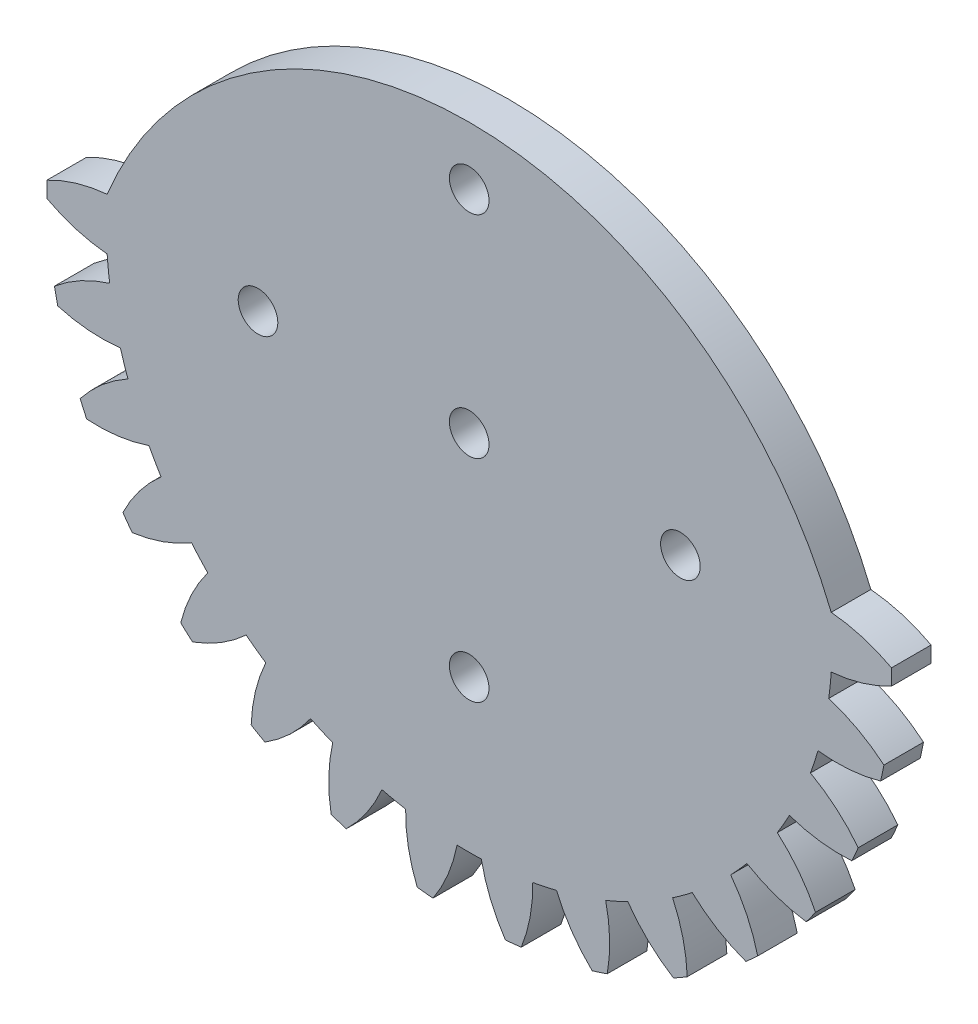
from build123d import *

# Parameters (mm, degrees)
EXTRUDE_1_DEPTH     = 3
SKETCH_2_R          = 1.5
CUT_EXTRUDE_1_DEPTH = 10
SKETCH_3_R          = 1.5
CUT_EXTRUDE_2_DEPTH = 10
CUT_EXTRUDE_3_DEPTH = 10


with BuildPart() as part:
    # Sketch 1 → Extrude 1 (new body)
    with BuildSketch(Plane.XY):
        with BuildLine():
            ThreePointArc((-88.734632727, 50.605995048), (-86.520028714, 49.698643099), (-84.169409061, 49.24881453))
            ThreePointArc((-84.169409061, 49.24881453), (-84.088655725, 48.333690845), (-83.977379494, 47.421775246))
            ThreePointArc((-83.977379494, 47.421775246), (-86.18310785, 46.493055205), (-88.160668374, 45.145089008))
            ThreePointArc((-88.160668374, 45.145089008), (-88.041021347, 44.554944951), (-87.910291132, 43.967156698))
            ThreePointArc((-87.910291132, 43.967156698), (-85.555432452, 43.540074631), (-83.16265486, 43.588797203))
            ThreePointArc((-83.16265486, 43.588797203), (-82.893401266, 42.710460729), (-82.594958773, 41.841608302))
            ThreePointArc((-82.594958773, 41.841608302), (-84.559394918, 40.47458631), (-86.213483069, 38.744918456))
            ThreePointArc((-86.213483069, 38.744918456), (-85.973752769, 38.192546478), (-85.723671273, 37.64478315))
            ThreePointArc((-85.723671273, 37.64478315), (-83.33147655, 37.7166365), (-81.001116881, 38.261780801))
            ThreePointArc((-81.001116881, 38.261780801), (-80.555130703, 37.458619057), (-80.082565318, 36.670802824))
            ThreePointArc((-80.082565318, 36.670802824), (-81.719853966, 34.925224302), (-82.978178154, 32.889449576))
            ThreePointArc((-82.978178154, 32.889449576), (-82.628841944, 32.398990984), (-82.270338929, 31.915192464))
            ThreePointArc((-82.270338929, 31.915192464), (-79.945358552, 32.482840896), (-77.779264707, 33.500581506))
            ThreePointArc((-77.779264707, 33.500581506), (-77.17603768, 32.807696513), (-76.550002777, 32.135347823))
            ThreePointArc((-76.550002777, 32.135347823), (-77.788586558, 30.087502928), (-78.596151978, 27.834594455))
            ThreePointArc((-78.596151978, 27.834594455), (-78.152477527, 27.427484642), (-77.701221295, 27.028795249))
            ThreePointArc((-77.701221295, 27.028795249), (-75.545068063, 28.067429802), (-73.637908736, 29.513286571))
            ThreePointArc((-73.637908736, 29.513286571), (-72.903804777, 28.960960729), (-72.151661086, 28.433464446))
            ThreePointArc((-72.151661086, 28.433464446), (-72.937407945, 26.172853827), (-73.258920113, 23.801274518))
            ThreePointArc((-73.258920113, 23.801274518), (-72.740298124, 23.495306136), (-72.216010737, 23.199150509))
            ThreePointArc((-72.216010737, 23.199150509), (-70.322918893, 24.663377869), (-68.758046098, 26.474159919))
            ThreePointArc((-68.758046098, 26.474159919), (-67.925149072, 26.086532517), (-67.079768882, 25.72694276))
            ThreePointArc((-67.079768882, 25.72694276), (-67.37833791, 23.35236595), (-67.199745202, 20.9657652))
            ThreePointArc((-67.199745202, 20.9657652), (-66.628841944, 20.774310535), (-66.054437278, 20.593632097))
            ThreePointArc((-66.054437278, 20.593632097), (-64.507144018, 22.419458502), (-63.352950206, 24.516025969))
            ThreePointArc((-63.352950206, 24.516025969), (-62.45766171, 24.310038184), (-61.55599219, 24.134070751))
            ThreePointArc((-61.55599219, 24.134070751), (-61.35433449, 21.749308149), (-60.683442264, 19.451991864))
            ThreePointArc((-60.683442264, 19.451991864), (-60.085208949, 19.383418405), (-59.485791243, 19.326113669))
            ThreePointArc((-59.485791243, 19.326113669), (-58.351920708, 21.433741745), (-57.658849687, 23.724464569))
            ThreePointArc((-57.658849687, 23.724464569), (-56.740298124, 23.709119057), (-55.82174656, 23.724464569))
            ThreePointArc((-55.82174656, 23.724464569), (-55.12867554, 21.433741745), (-53.994805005, 19.326113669))
            ThreePointArc((-53.994805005, 19.326113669), (-53.395387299, 19.383418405), (-52.797153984, 19.451991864))
            ThreePointArc((-52.797153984, 19.451991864), (-52.126261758, 21.749308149), (-51.924604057, 24.134070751))
            ThreePointArc((-51.924604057, 24.134070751), (-51.022934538, 24.310038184), (-50.127646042, 24.516025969))
            ThreePointArc((-50.127646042, 24.516025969), (-48.97345223, 22.419458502), (-47.42615897, 20.593632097))
            ThreePointArc((-47.42615897, 20.593632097), (-46.851754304, 20.774310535), (-46.280851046, 20.9657652))
            ThreePointArc((-46.280851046, 20.9657652), (-46.102258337, 23.35236595), (-46.400827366, 25.72694276))
            ThreePointArc((-46.400827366, 25.72694276), (-45.555447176, 26.086532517), (-44.72255015, 26.474159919))
            ThreePointArc((-44.72255015, 26.474159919), (-43.157677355, 24.663377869), (-41.264585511, 23.199150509))
            ThreePointArc((-41.264585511, 23.199150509), (-40.740298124, 23.495306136), (-40.221676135, 23.801274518))
            ThreePointArc((-40.221676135, 23.801274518), (-40.543188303, 26.172853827), (-41.328935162, 28.433464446))
            ThreePointArc((-41.328935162, 28.433464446), (-40.576791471, 28.960960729), (-39.842687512, 29.513286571))
            ThreePointArc((-39.842687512, 29.513286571), (-37.935528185, 28.067429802), (-35.779374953, 27.028795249))
            ThreePointArc((-35.779374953, 27.028795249), (-35.32811872, 27.427484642), (-34.88444427, 27.834594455))
            ThreePointArc((-34.88444427, 27.834594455), (-35.69200969, 30.087502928), (-36.930593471, 32.135347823))
            ThreePointArc((-36.930593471, 32.135347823), (-36.304558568, 32.807696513), (-35.701331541, 33.500581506))
            ThreePointArc((-35.701331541, 33.500581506), (-33.535237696, 32.482840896), (-31.210257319, 31.915192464))
            ThreePointArc((-31.210257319, 31.915192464), (-30.851754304, 32.398990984), (-30.502418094, 32.889449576))
            ThreePointArc((-30.502418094, 32.889449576), (-31.760742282, 34.925224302), (-33.39803093, 36.670802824))
            ThreePointArc((-33.39803093, 36.670802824), (-32.925465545, 37.458619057), (-32.479479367, 38.261780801))
            ThreePointArc((-32.479479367, 38.261780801), (-30.149119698, 37.7166365), (-27.756924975, 37.64478315))
            ThreePointArc((-27.756924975, 37.64478315), (-27.506843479, 38.192546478), (-27.267113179, 38.744918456))
            ThreePointArc((-27.267113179, 38.744918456), (-28.92120133, 40.47458631), (-30.885637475, 41.841608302))
            ThreePointArc((-30.885637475, 41.841608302), (-30.587194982, 42.710460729), (-30.317941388, 43.588797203))
            ThreePointArc((-30.317941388, 43.588797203), (-27.925163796, 43.540074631), (-25.570305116, 43.967156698))
            ThreePointArc((-25.570305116, 43.967156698), (-25.4395749, 44.554944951), (-25.319927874, 45.145089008))
            ThreePointArc((-25.319927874, 45.145089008), (-27.297488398, 46.493055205), (-29.503216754, 47.421775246))
            ThreePointArc((-29.503216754, 47.421775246), (-29.391940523, 48.333690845), (-29.311187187, 49.24881453))
            ThreePointArc((-29.311187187, 49.24881453), (-26.960567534, 49.698643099), (-24.745963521, 50.605995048))
            ThreePointArc((-24.745963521, 50.605995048), (-24.740298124, 51.208119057), (-24.745963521, 51.810243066))
            ThreePointArc((-24.745963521, 51.810243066), (-26.960567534, 52.717595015), (-29.311187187, 53.167423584))
            ThreePointArc((-29.311187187, 53.167423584), (-29.391940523, 54.082547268), (-29.503216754, 54.994462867))
            ThreePointArc((-29.503216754, 54.994462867), (-27.297488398, 55.923182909), (-25.319927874, 57.271149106))
            ThreePointArc((-25.319927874, 57.271149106), (-25.4395749, 57.861293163), (-25.570305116, 58.449081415))
            ThreePointArc((-25.570305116, 58.449081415), (-27.925163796, 58.876163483), (-30.317941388, 58.827440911))
            ThreePointArc((-30.317941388, 58.827440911), (-30.587194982, 59.705777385), (-30.885637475, 60.574629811))
            ThreePointArc((-30.885637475, 60.574629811), (-28.92120133, 61.941651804), (-27.267113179, 63.671319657))
            ThreePointArc((-27.267113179, 63.671319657), (-27.506843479, 64.223691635), (-27.756924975, 64.771454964))
            ThreePointArc((-27.756924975, 64.771454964), (-30.149119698, 64.699601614), (-32.479479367, 64.154457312))
            ThreePointArc((-32.479479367, 64.154457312), (-32.925465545, 64.957619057), (-33.39803093, 65.74543529))
            ThreePointArc((-33.39803093, 65.74543529), (-31.760742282, 67.491013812), (-30.502418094, 69.526788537))
            ThreePointArc((-30.502418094, 69.526788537), (-30.851754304, 70.01724713), (-31.210257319, 70.501045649))
            ThreePointArc((-31.210257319, 70.501045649), (-33.535237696, 69.933397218), (-35.701331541, 68.915656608))
            ThreePointArc((-35.701331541, 68.915656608), (-36.304558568, 69.608541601), (-36.930593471, 70.280890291))
            ThreePointArc((-36.930593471, 70.280890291), (-35.69200969, 72.328735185), (-34.88444427, 74.581643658))
            ThreePointArc((-34.88444427, 74.581643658), (-35.32811872, 74.988753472), (-35.779374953, 75.387442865))
            ThreePointArc((-35.779374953, 75.387442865), (-37.935528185, 74.348808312), (-39.842687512, 72.902951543))
            ThreePointArc((-39.842687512, 72.902951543), (-40.576791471, 73.455277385), (-41.328935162, 73.982773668))
            ThreePointArc((-41.328935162, 73.982773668), (-40.543188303, 76.243384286), (-40.221676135, 78.614963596))
            ThreePointArc((-40.221676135, 78.614963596), (-40.740298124, 78.920931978), (-41.264585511, 79.217087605))
            ThreePointArc((-41.264585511, 79.217087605), (-43.157677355, 77.752860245), (-44.72255015, 75.942078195))
            ThreePointArc((-44.72255015, 75.942078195), (-45.555447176, 76.329705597), (-46.400827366, 76.689295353))
            ThreePointArc((-46.400827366, 76.689295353), (-46.102258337, 79.063872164), (-46.280851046, 81.450472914))
            ThreePointArc((-46.280851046, 81.450472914), (-46.851754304, 81.641927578), (-47.42615897, 81.822606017))
            ThreePointArc((-47.42615897, 81.822606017), (-48.97345223, 79.996779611), (-50.127646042, 77.900212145))
            ThreePointArc((-50.127646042, 77.900212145), (-51.022934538, 78.106199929), (-51.924604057, 78.282167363))
            ThreePointArc((-51.924604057, 78.282167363), (-52.126261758, 80.666929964), (-52.797153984, 82.96424625))
            ThreePointArc((-52.797153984, 82.96424625), (-53.395387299, 83.032819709), (-53.994805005, 83.090124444))
            ThreePointArc((-53.994805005, 83.090124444), (-55.12867554, 80.982496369), (-55.82174656, 78.691773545))
            ThreePointArc((-55.82174656, 78.691773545), (-56.740298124, 78.707119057), (-57.658849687, 78.691773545))
            ThreePointArc((-57.658849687, 78.691773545), (-58.351920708, 80.982496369), (-59.485791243, 83.090124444))
            ThreePointArc((-59.485791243, 83.090124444), (-60.085208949, 83.032819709), (-60.683442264, 82.96424625))
            ThreePointArc((-60.683442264, 82.96424625), (-61.35433449, 80.666929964), (-61.55599219, 78.282167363))
            ThreePointArc((-61.55599219, 78.282167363), (-62.45766171, 78.106199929), (-63.352950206, 77.900212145))
            ThreePointArc((-63.352950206, 77.900212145), (-64.507144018, 79.996779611), (-66.054437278, 81.822606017))
            ThreePointArc((-66.054437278, 81.822606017), (-66.628841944, 81.641927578), (-67.199745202, 81.450472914))
            ThreePointArc((-67.199745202, 81.450472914), (-67.37833791, 79.063872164), (-67.079768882, 76.689295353))
            ThreePointArc((-67.079768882, 76.689295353), (-67.925149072, 76.329705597), (-68.758046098, 75.942078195))
            ThreePointArc((-68.758046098, 75.942078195), (-70.322918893, 77.752860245), (-72.216010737, 79.217087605))
            ThreePointArc((-72.216010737, 79.217087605), (-72.740298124, 78.920931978), (-73.258920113, 78.614963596))
            ThreePointArc((-73.258920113, 78.614963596), (-72.937407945, 76.243384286), (-72.151661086, 73.982773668))
            ThreePointArc((-72.151661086, 73.982773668), (-72.903804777, 73.455277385), (-73.637908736, 72.902951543))
            ThreePointArc((-73.637908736, 72.902951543), (-75.545068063, 74.348808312), (-77.701221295, 75.387442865))
            ThreePointArc((-77.701221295, 75.387442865), (-78.152477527, 74.988753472), (-78.596151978, 74.581643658))
            ThreePointArc((-78.596151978, 74.581643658), (-77.788586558, 72.328735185), (-76.550002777, 70.280890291))
            ThreePointArc((-76.550002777, 70.280890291), (-77.17603768, 69.608541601), (-77.779264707, 68.915656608))
            ThreePointArc((-77.779264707, 68.915656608), (-79.945358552, 69.933397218), (-82.270338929, 70.501045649))
            ThreePointArc((-82.270338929, 70.501045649), (-82.628841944, 70.01724713), (-82.978178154, 69.526788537))
            ThreePointArc((-82.978178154, 69.526788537), (-81.719853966, 67.491013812), (-80.082565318, 65.74543529))
            ThreePointArc((-80.082565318, 65.74543529), (-80.555130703, 64.957619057), (-81.001116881, 64.154457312))
            ThreePointArc((-81.001116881, 64.154457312), (-83.33147655, 64.699601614), (-85.723671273, 64.771454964))
            ThreePointArc((-85.723671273, 64.771454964), (-85.973752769, 64.223691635), (-86.213483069, 63.671319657))
            ThreePointArc((-86.213483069, 63.671319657), (-84.559394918, 61.941651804), (-82.594958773, 60.574629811))
            ThreePointArc((-82.594958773, 60.574629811), (-82.893401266, 59.705777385), (-83.16265486, 58.827440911))
            ThreePointArc((-83.16265486, 58.827440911), (-85.555432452, 58.876163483), (-87.910291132, 58.449081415))
            ThreePointArc((-87.910291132, 58.449081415), (-88.041021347, 57.861293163), (-88.160668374, 57.271149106))
            ThreePointArc((-88.160668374, 57.271149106), (-86.18310785, 55.923182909), (-83.977379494, 54.994462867))
            ThreePointArc((-83.977379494, 54.994462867), (-84.088655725, 54.082547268), (-84.169409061, 53.167423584))
            ThreePointArc((-84.169409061, 53.167423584), (-86.520028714, 52.717595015), (-88.734632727, 51.810243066))
            ThreePointArc((-88.734632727, 51.810243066), (-88.740298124, 51.208119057), (-88.734632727, 50.605995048))
        make_face()
    extrude(amount=EXTRUDE_1_DEPTH)

    # Sketch 2 → Cut-Extrude 1 (cut)
    with BuildSketch(Plane.XY.offset(3)):
        with Locations((-56.740298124, 67.208119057)):
            Circle(SKETCH_2_R)
        with Locations((-40.740298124, 51.208119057)):
            Circle(SKETCH_2_R)
        with Locations((-56.740298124, 35.208119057)):
            Circle(SKETCH_2_R)
        with Locations((-72.740298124, 51.208119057)):
            Circle(SKETCH_2_R)
    extrude(amount=-CUT_EXTRUDE_1_DEPTH, mode=Mode.SUBTRACT)

    # Sketch 3 → Cut-Extrude 2 (cut)
    with BuildSketch(Plane.XY.offset(3)):
        with Locations((-56.740298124, 51.208119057)):
            Circle(SKETCH_3_R)
    extrude(amount=-CUT_EXTRUDE_2_DEPTH, mode=Mode.SUBTRACT)

    # Sketch 4 → Cut-Extrude 3 (cut)
    with BuildSketch(Plane.XY.offset(3)):
        with BuildLine():
            Line((-84.169409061, 53.167423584), (-102.427084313, 70.512800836))
            Line((-102.427084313, 70.512800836), (-65.989677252, 86.302343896))
            Line((-65.989677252, 86.302343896), (-22.264788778, 82.537145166))
            Line((-22.264788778, 82.537145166), (-9.147322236, 61.84011221))
            Line((-9.147322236, 61.84011221), (-9.147322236, 58.488456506))
            Line((-9.147322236, 58.488456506), (-29.311187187, 53.167423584))
            ThreePointArc((-29.311187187, 53.167423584), (-56.740298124, 71.615353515), (-84.169409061, 53.167423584))
        make_face()
    extrude(amount=-CUT_EXTRUDE_3_DEPTH, mode=Mode.SUBTRACT)


solid = part.part
